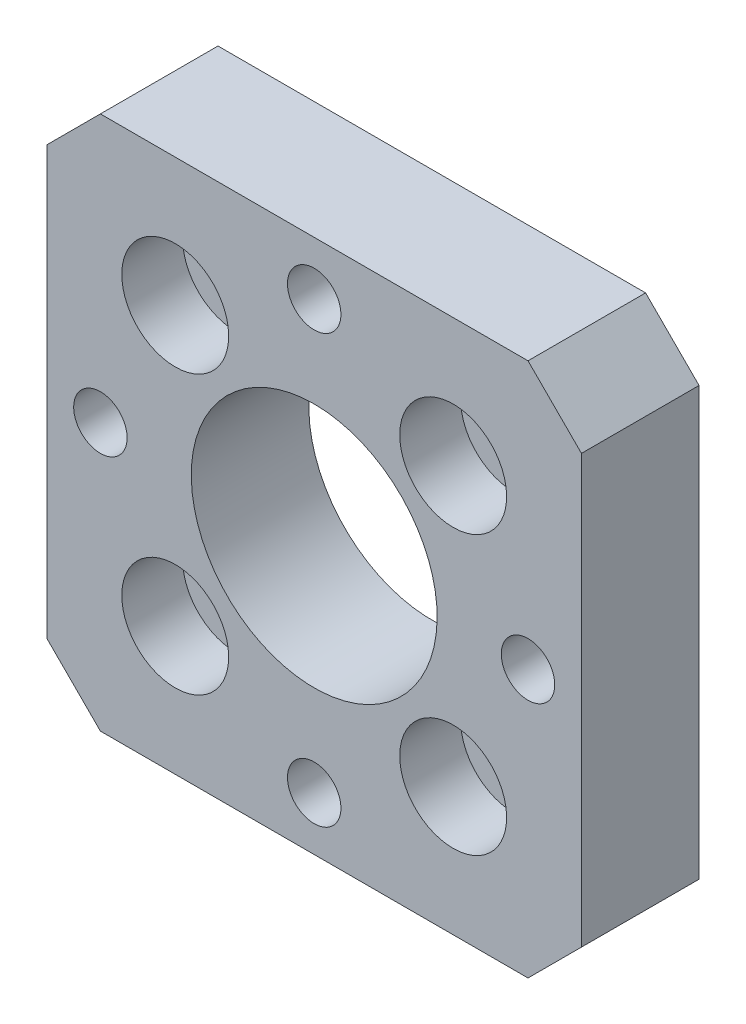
ISO-10303-21;
HEADER;
FILE_DESCRIPTION(('STEP AP214'),'2;1');
FILE_NAME('part.step','',(''),(''),'','','');
FILE_SCHEMA(('AUTOMOTIVE_DESIGN { 1 0 10303 214 1 1 1 1 }'));
ENDSEC;
DATA;
#1=APPLICATION_CONTEXT('core data for automotive mechanical design processes');
#2=APPLICATION_PROTOCOL_DEFINITION('international standard','automotive_design',2000,#1);
#3=PRODUCT_CONTEXT('',#1,'mechanical');
#4=PRODUCT('Part','Part','',(#3));
#5=PRODUCT_RELATED_PRODUCT_CATEGORY('part','',(#4));
#6=PRODUCT_DEFINITION_FORMATION('','',#4);
#7=PRODUCT_DEFINITION_CONTEXT('part definition',#1,'design');
#8=PRODUCT_DEFINITION('design','',#6,#7);
#9=PRODUCT_DEFINITION_SHAPE('','',#8);
#10=(LENGTH_UNIT() NAMED_UNIT(*) SI_UNIT(.MILLI.,.METRE.));
#11=(NAMED_UNIT(*) PLANE_ANGLE_UNIT() SI_UNIT($,.RADIAN.));
#12=(NAMED_UNIT(*) SI_UNIT($,.STERADIAN.) SOLID_ANGLE_UNIT());
#13=UNCERTAINTY_MEASURE_WITH_UNIT(LENGTH_MEASURE(1.E-05),#10,'distance_accuracy_value','');
#14=(GEOMETRIC_REPRESENTATION_CONTEXT(3) GLOBAL_UNCERTAINTY_ASSIGNED_CONTEXT((#13)) GLOBAL_UNIT_ASSIGNED_CONTEXT((#10,
#11,#12)) REPRESENTATION_CONTEXT('',''));
#15=CARTESIAN_POINT('',(0.,0.,0.));
#16=DIRECTION('',(0.,0.,1.));
#17=DIRECTION('',(1.,0.,0.));
#18=AXIS2_PLACEMENT_3D('',#15,#16,#17);
#19=CARTESIAN_POINT('',(26515.7035196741,-17322.3007866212,-13740.4776610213));
#20=DIRECTION('',(0.,0.,1.));
#21=DIRECTION('',(0.,-1.,0.));
#22=AXIS2_PLACEMENT_3D('',#19,#20,#21);
#23=CYLINDRICAL_SURFACE('',#22,5.);
#24=CARTESIAN_POINT('',(26515.7035196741,-17322.3007866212,-13746.1776610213));
#25=DIRECTION('',(0.,0.,1.));
#26=DIRECTION('',(0.,-1.,0.));
#27=AXIS2_PLACEMENT_3D('',#24,#25,#26);
#28=CIRCLE('',#27,5.);
#29=CARTESIAN_POINT('',(26515.7035196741,-17327.3007866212,-13746.1776610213));
#30=VERTEX_POINT('',#29);
#31=EDGE_CURVE('E19',#30,#30,#28,.F.);
#32=ORIENTED_EDGE('',*,*,#31,.T.);
#33=EDGE_LOOP('',(#32));
#34=FACE_BOUND('',#33,.T.);
#35=CARTESIAN_POINT('',(26515.7035196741,-17322.3007866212,-13740.4776610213));
#36=DIRECTION('',(0.,0.,1.));
#37=DIRECTION('',(0.,-1.,0.));
#38=AXIS2_PLACEMENT_3D('',#35,#36,#37);
#39=CIRCLE('',#38,5.);
#40=CARTESIAN_POINT('',(26515.7035196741,-17327.3007866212,-13740.4776610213));
#41=VERTEX_POINT('',#40);
#42=EDGE_CURVE('E165',#41,#41,#39,.F.);
#43=ORIENTED_EDGE('',*,*,#42,.F.);
#44=EDGE_LOOP('',(#43));
#45=FACE_BOUND('',#44,.T.);
#46=ADVANCED_FACE('F16',(#34,#45),#23,.F.);
#47=CARTESIAN_POINT('',(26489.7035196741,-17322.3007866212,-13740.4776610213));
#48=DIRECTION('',(0.,0.,1.));
#49=DIRECTION('',(0.,-1.,0.));
#50=AXIS2_PLACEMENT_3D('',#47,#48,#49);
#51=CYLINDRICAL_SURFACE('',#50,5.);
#52=CARTESIAN_POINT('',(26489.7035196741,-17322.3007866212,-13746.1776610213));
#53=DIRECTION('',(0.,0.,1.));
#54=DIRECTION('',(0.,-1.,0.));
#55=AXIS2_PLACEMENT_3D('',#52,#53,#54);
#56=CIRCLE('',#55,5.);
#57=CARTESIAN_POINT('',(26489.7035196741,-17327.3007866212,-13746.1776610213));
#58=VERTEX_POINT('',#57);
#59=EDGE_CURVE('E173',#58,#58,#56,.F.);
#60=ORIENTED_EDGE('',*,*,#59,.T.);
#61=EDGE_LOOP('',(#60));
#62=FACE_BOUND('',#61,.T.);
#63=CARTESIAN_POINT('',(26489.7035196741,-17322.3007866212,-13740.4776610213));
#64=DIRECTION('',(0.,0.,1.));
#65=DIRECTION('',(0.,-1.,0.));
#66=AXIS2_PLACEMENT_3D('',#63,#64,#65);
#67=CIRCLE('',#66,5.);
#68=CARTESIAN_POINT('',(26489.7035196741,-17327.3007866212,-13740.4776610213));
#69=VERTEX_POINT('',#68);
#70=EDGE_CURVE('E162',#69,#69,#67,.F.);
#71=ORIENTED_EDGE('',*,*,#70,.F.);
#72=EDGE_LOOP('',(#71));
#73=FACE_BOUND('',#72,.T.);
#74=ADVANCED_FACE('F247',(#62,#73),#51,.F.);
#75=CARTESIAN_POINT('',(26489.7035196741,-17348.3007866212,-13740.4776610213));
#76=DIRECTION('',(0.,0.,1.));
#77=DIRECTION('',(0.,-1.,0.));
#78=AXIS2_PLACEMENT_3D('',#75,#76,#77);
#79=CYLINDRICAL_SURFACE('',#78,5.);
#80=CARTESIAN_POINT('',(26489.7035196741,-17348.3007866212,-13746.1776610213));
#81=DIRECTION('',(0.,0.,1.));
#82=DIRECTION('',(0.,-1.,0.));
#83=AXIS2_PLACEMENT_3D('',#80,#81,#82);
#84=CIRCLE('',#83,5.);
#85=CARTESIAN_POINT('',(26489.7035196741,-17353.3007866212,-13746.1776610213));
#86=VERTEX_POINT('',#85);
#87=EDGE_CURVE('E171',#86,#86,#84,.F.);
#88=ORIENTED_EDGE('',*,*,#87,.T.);
#89=EDGE_LOOP('',(#88));
#90=FACE_BOUND('',#89,.T.);
#91=CARTESIAN_POINT('',(26489.7035196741,-17348.3007866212,-13740.4776610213));
#92=DIRECTION('',(0.,0.,1.));
#93=DIRECTION('',(0.,-1.,0.));
#94=AXIS2_PLACEMENT_3D('',#91,#92,#93);
#95=CIRCLE('',#94,5.);
#96=CARTESIAN_POINT('',(26489.7035196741,-17353.3007866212,-13740.4776610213));
#97=VERTEX_POINT('',#96);
#98=EDGE_CURVE('E159',#97,#97,#95,.F.);
#99=ORIENTED_EDGE('',*,*,#98,.F.);
#100=EDGE_LOOP('',(#99));
#101=FACE_BOUND('',#100,.T.);
#102=ADVANCED_FACE('F244',(#90,#101),#79,.F.);
#103=CARTESIAN_POINT('',(26515.7035196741,-17348.3007866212,-13740.4776610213));
#104=DIRECTION('',(0.,0.,1.));
#105=DIRECTION('',(0.,-1.,0.));
#106=AXIS2_PLACEMENT_3D('',#103,#104,#105);
#107=CYLINDRICAL_SURFACE('',#106,5.);
#108=CARTESIAN_POINT('',(26515.7035196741,-17348.3007866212,-13746.1776610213));
#109=DIRECTION('',(0.,0.,1.));
#110=DIRECTION('',(0.,-1.,0.));
#111=AXIS2_PLACEMENT_3D('',#108,#109,#110);
#112=CIRCLE('',#111,5.);
#113=CARTESIAN_POINT('',(26515.7035196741,-17353.3007866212,-13746.1776610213));
#114=VERTEX_POINT('',#113);
#115=EDGE_CURVE('E168',#114,#114,#112,.F.);
#116=ORIENTED_EDGE('',*,*,#115,.T.);
#117=EDGE_LOOP('',(#116));
#118=FACE_BOUND('',#117,.T.);
#119=CARTESIAN_POINT('',(26515.7035196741,-17348.3007866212,-13740.4776610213));
#120=DIRECTION('',(0.,0.,1.));
#121=DIRECTION('',(0.,-1.,0.));
#122=AXIS2_PLACEMENT_3D('',#119,#120,#121);
#123=CIRCLE('',#122,5.);
#124=CARTESIAN_POINT('',(26515.7035196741,-17353.3007866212,-13740.4776610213));
#125=VERTEX_POINT('',#124);
#126=EDGE_CURVE('E156',#125,#125,#123,.F.);
#127=ORIENTED_EDGE('',*,*,#126,.F.);
#128=EDGE_LOOP('',(#127));
#129=FACE_BOUND('',#128,.T.);
#130=ADVANCED_FACE('F186',(#118,#129),#107,.F.);
#131=CARTESIAN_POINT('',(26515.7035196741,-17325.0507866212,-13746.1776610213));
#132=DIRECTION('',(0.,0.,-1.));
#133=DIRECTION('',(0.,1.,0.));
#134=AXIS2_PLACEMENT_3D('',#131,#132,#133);
#135=PLANE('',#134);
#136=ORIENTED_EDGE('',*,*,#31,.F.);
#137=EDGE_LOOP('',(#136));
#138=FACE_BOUND('',#137,.T.);
#139=CARTESIAN_POINT('',(26515.7035196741,-17322.3007866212,-13746.1776610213));
#140=DIRECTION('',(0.,0.,1.));
#141=DIRECTION('',(0.,-1.,0.));
#142=AXIS2_PLACEMENT_3D('',#139,#140,#141);
#143=CIRCLE('',#142,2.75);
#144=CARTESIAN_POINT('',(26515.7035196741,-17325.0507866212,-13746.1776610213));
#145=VERTEX_POINT('',#144);
#146=EDGE_CURVE('E141',#145,#145,#143,.F.);
#147=ORIENTED_EDGE('',*,*,#146,.T.);
#148=EDGE_LOOP('',(#147));
#149=FACE_BOUND('',#148,.T.);
#150=ADVANCED_FACE('F182',(#138,#149),#135,.F.);
#151=CARTESIAN_POINT('',(26489.7035196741,-17325.0507866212,-13746.1776610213));
#152=DIRECTION('',(0.,0.,-1.));
#153=DIRECTION('',(0.,1.,0.));
#154=AXIS2_PLACEMENT_3D('',#151,#152,#153);
#155=PLANE('',#154);
#156=ORIENTED_EDGE('',*,*,#59,.F.);
#157=EDGE_LOOP('',(#156));
#158=FACE_BOUND('',#157,.T.);
#159=CARTESIAN_POINT('',(26489.7035196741,-17322.3007866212,-13746.1776610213));
#160=DIRECTION('',(0.,0.,1.));
#161=DIRECTION('',(0.,-1.,0.));
#162=AXIS2_PLACEMENT_3D('',#159,#160,#161);
#163=CIRCLE('',#162,2.75);
#164=CARTESIAN_POINT('',(26489.7035196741,-17325.0507866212,-13746.1776610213));
#165=VERTEX_POINT('',#164);
#166=EDGE_CURVE('E138',#165,#165,#163,.F.);
#167=ORIENTED_EDGE('',*,*,#166,.T.);
#168=EDGE_LOOP('',(#167));
#169=FACE_BOUND('',#168,.T.);
#170=ADVANCED_FACE('F185',(#158,#169),#155,.F.);
#171=CARTESIAN_POINT('',(26489.7035196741,-17351.0507866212,-13746.1776610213));
#172=DIRECTION('',(0.,0.,-1.));
#173=DIRECTION('',(0.,1.,0.));
#174=AXIS2_PLACEMENT_3D('',#171,#172,#173);
#175=PLANE('',#174);
#176=ORIENTED_EDGE('',*,*,#87,.F.);
#177=EDGE_LOOP('',(#176));
#178=FACE_BOUND('',#177,.T.);
#179=CARTESIAN_POINT('',(26489.7035196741,-17348.3007866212,-13746.1776610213));
#180=DIRECTION('',(0.,0.,1.));
#181=DIRECTION('',(0.,-1.,0.));
#182=AXIS2_PLACEMENT_3D('',#179,#180,#181);
#183=CIRCLE('',#182,2.75);
#184=CARTESIAN_POINT('',(26489.7035196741,-17351.0507866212,-13746.1776610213));
#185=VERTEX_POINT('',#184);
#186=EDGE_CURVE('E135',#185,#185,#183,.F.);
#187=ORIENTED_EDGE('',*,*,#186,.T.);
#188=EDGE_LOOP('',(#187));
#189=FACE_BOUND('',#188,.T.);
#190=ADVANCED_FACE('F234',(#178,#189),#175,.F.);
#191=CARTESIAN_POINT('',(26515.7035196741,-17351.0507866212,-13746.1776610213));
#192=DIRECTION('',(0.,0.,-1.));
#193=DIRECTION('',(0.,1.,0.));
#194=AXIS2_PLACEMENT_3D('',#191,#192,#193);
#195=PLANE('',#194);
#196=ORIENTED_EDGE('',*,*,#115,.F.);
#197=EDGE_LOOP('',(#196));
#198=FACE_BOUND('',#197,.T.);
#199=CARTESIAN_POINT('',(26515.7035196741,-17348.3007866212,-13746.1776610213));
#200=DIRECTION('',(0.,0.,1.));
#201=DIRECTION('',(0.,-1.,0.));
#202=AXIS2_PLACEMENT_3D('',#199,#200,#201);
#203=CIRCLE('',#202,2.75);
#204=CARTESIAN_POINT('',(26515.7035196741,-17351.0507866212,-13746.1776610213));
#205=VERTEX_POINT('',#204);
#206=EDGE_CURVE('E91',#205,#205,#203,.F.);
#207=ORIENTED_EDGE('',*,*,#206,.T.);
#208=EDGE_LOOP('',(#207));
#209=FACE_BOUND('',#208,.T.);
#210=ADVANCED_FACE('F226',(#198,#209),#195,.F.);
#211=CARTESIAN_POINT('',(26477.7035196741,-17310.3007866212,-13740.4776610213));
#212=DIRECTION('',(0.,0.,1.));
#213=DIRECTION('',(0.,-1.,0.));
#214=AXIS2_PLACEMENT_3D('',#211,#212,#213);
#215=PLANE('',#214);
#216=CARTESIAN_POINT('',(26502.7035196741,-17335.3007866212,-13740.4776610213));
#217=DIRECTION('',(0.,0.,-1.));
#218=DIRECTION('',(0.,1.,0.));
#219=AXIS2_PLACEMENT_3D('',#216,#217,#218);
#220=CIRCLE('',#219,11.5);
#221=CARTESIAN_POINT('',(26502.7035196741,-17323.8007866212,-13740.4776610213));
#222=VERTEX_POINT('',#221);
#223=EDGE_CURVE('E130',#222,#222,#220,.T.);
#224=ORIENTED_EDGE('',*,*,#223,.T.);
#225=EDGE_LOOP('',(#224));
#226=FACE_BOUND('',#225,.T.);
#227=DIRECTION('',(1.,0.,0.));
#228=VECTOR('',#227,1.);
#229=CARTESIAN_POINT('',(26527.7035196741,-17360.3007866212,-13740.4776610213));
#230=LINE('',#229,#228);
#231=CARTESIAN_POINT('',(26482.7035196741,-17360.3007866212,-13740.4776610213));
#232=VERTEX_POINT('',#231);
#233=CARTESIAN_POINT('',(26522.7035196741,-17360.3007866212,-13740.4776610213));
#234=VERTEX_POINT('',#233);
#235=EDGE_CURVE('E376',#232,#234,#230,.T.);
#236=ORIENTED_EDGE('',*,*,#235,.T.);
#237=DIRECTION('',(-0.707106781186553,-0.707106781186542,0.));
#238=VECTOR('',#237,1.);
#239=CARTESIAN_POINT('',(26527.7035196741,-17355.3007866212,-13740.4776610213));
#240=LINE('',#239,#238);
#241=CARTESIAN_POINT('',(26527.7035196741,-17355.3007866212,-13740.4776610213));
#242=VERTEX_POINT('',#241);
#243=EDGE_CURVE('E371',#234,#242,#240,.F.);
#244=ORIENTED_EDGE('',*,*,#243,.T.);
#245=DIRECTION('',(0.,-1.,0.));
#246=VECTOR('',#245,1.);
#247=CARTESIAN_POINT('',(26527.7035196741,-17310.3007866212,-13740.4776610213));
#248=LINE('',#247,#246);
#249=CARTESIAN_POINT('',(26527.7035196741,-17315.3007866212,-13740.4776610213));
#250=VERTEX_POINT('',#249);
#251=EDGE_CURVE('E368',#242,#250,#248,.F.);
#252=ORIENTED_EDGE('',*,*,#251,.T.);
#253=DIRECTION('',(0.707106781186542,-0.707106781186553,0.));
#254=VECTOR('',#253,1.);
#255=CARTESIAN_POINT('',(26522.7035196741,-17310.3007866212,-13740.4776610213));
#256=LINE('',#255,#254);
#257=CARTESIAN_POINT('',(26522.7035196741,-17310.3007866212,-13740.4776610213));
#258=VERTEX_POINT('',#257);
#259=EDGE_CURVE('E365',#250,#258,#256,.F.);
#260=ORIENTED_EDGE('',*,*,#259,.T.);
#261=DIRECTION('',(1.,0.,0.));
#262=VECTOR('',#261,1.);
#263=CARTESIAN_POINT('',(26527.7035196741,-17310.3007866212,-13740.4776610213));
#264=LINE('',#263,#262);
#265=CARTESIAN_POINT('',(26482.7035196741,-17310.3007866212,-13740.4776610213));
#266=VERTEX_POINT('',#265);
#267=EDGE_CURVE('E85',#258,#266,#264,.F.);
#268=ORIENTED_EDGE('',*,*,#267,.T.);
#269=DIRECTION('',(0.707106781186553,0.707106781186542,0.));
#270=VECTOR('',#269,1.);
#271=CARTESIAN_POINT('',(26477.7035196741,-17315.3007866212,-13740.4776610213));
#272=LINE('',#271,#270);
#273=CARTESIAN_POINT('',(26477.7035196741,-17315.3007866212,-13740.4776610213));
#274=VERTEX_POINT('',#273);
#275=EDGE_CURVE('E82',#266,#274,#272,.F.);
#276=ORIENTED_EDGE('',*,*,#275,.T.);
#277=DIRECTION('',(0.,1.,0.));
#278=VECTOR('',#277,1.);
#279=CARTESIAN_POINT('',(26477.7035196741,-17310.3007866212,-13740.4776610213));
#280=LINE('',#279,#278);
#281=CARTESIAN_POINT('',(26477.7035196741,-17355.3007866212,-13740.4776610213));
#282=VERTEX_POINT('',#281);
#283=EDGE_CURVE('E79',#274,#282,#280,.F.);
#284=ORIENTED_EDGE('',*,*,#283,.T.);
#285=DIRECTION('',(-0.707106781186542,0.707106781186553,0.));
#286=VECTOR('',#285,1.);
#287=CARTESIAN_POINT('',(26482.7035196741,-17360.3007866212,-13740.4776610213));
#288=LINE('',#287,#286);
#289=EDGE_CURVE('E381',#282,#232,#288,.F.);
#290=ORIENTED_EDGE('',*,*,#289,.T.);
#291=EDGE_LOOP('',(#236,#244,#252,#260,#268,#276,#284,#290));
#292=FACE_BOUND('',#291,.T.);
#293=ORIENTED_EDGE('',*,*,#126,.T.);
#294=EDGE_LOOP('',(#293));
#295=FACE_BOUND('',#294,.T.);
#296=ORIENTED_EDGE('',*,*,#98,.T.);
#297=EDGE_LOOP('',(#296));
#298=FACE_BOUND('',#297,.T.);
#299=ORIENTED_EDGE('',*,*,#70,.T.);
#300=EDGE_LOOP('',(#299));
#301=FACE_BOUND('',#300,.T.);
#302=ORIENTED_EDGE('',*,*,#42,.T.);
#303=EDGE_LOOP('',(#302));
#304=FACE_BOUND('',#303,.T.);
#305=CARTESIAN_POINT('',(26502.7035196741,-17355.3007866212,-13740.4776610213));
#306=DIRECTION('',(0.,0.,1.));
#307=DIRECTION('',(0.,-1.,0.));
#308=AXIS2_PLACEMENT_3D('',#305,#306,#307);
#309=CIRCLE('',#308,2.5);
#310=CARTESIAN_POINT('',(26502.7035196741,-17357.8007866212,-13740.4776610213));
#311=VERTEX_POINT('',#310);
#312=EDGE_CURVE('E144',#311,#311,#309,.F.);
#313=ORIENTED_EDGE('',*,*,#312,.T.);
#314=EDGE_LOOP('',(#313));
#315=FACE_BOUND('',#314,.T.);
#316=CARTESIAN_POINT('',(26502.7035196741,-17315.3007866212,-13740.4776610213));
#317=DIRECTION('',(0.,0.,1.));
#318=DIRECTION('',(0.,-1.,0.));
#319=AXIS2_PLACEMENT_3D('',#316,#317,#318);
#320=CIRCLE('',#319,2.5);
#321=CARTESIAN_POINT('',(26502.7035196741,-17317.8007866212,-13740.4776610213));
#322=VERTEX_POINT('',#321);
#323=EDGE_CURVE('E147',#322,#322,#320,.F.);
#324=ORIENTED_EDGE('',*,*,#323,.T.);
#325=EDGE_LOOP('',(#324));
#326=FACE_BOUND('',#325,.T.);
#327=CARTESIAN_POINT('',(26482.7035196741,-17335.3007866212,-13740.4776610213));
#328=DIRECTION('',(0.,0.,1.));
#329=DIRECTION('',(0.,-1.,0.));
#330=AXIS2_PLACEMENT_3D('',#327,#328,#329);
#331=CIRCLE('',#330,2.5);
#332=CARTESIAN_POINT('',(26482.7035196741,-17337.8007866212,-13740.4776610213));
#333=VERTEX_POINT('',#332);
#334=EDGE_CURVE('E150',#333,#333,#331,.F.);
#335=ORIENTED_EDGE('',*,*,#334,.T.);
#336=EDGE_LOOP('',(#335));
#337=FACE_BOUND('',#336,.T.);
#338=CARTESIAN_POINT('',(26522.7035196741,-17335.3007866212,-13740.4776610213));
#339=DIRECTION('',(0.,0.,1.));
#340=DIRECTION('',(0.,-1.,0.));
#341=AXIS2_PLACEMENT_3D('',#338,#339,#340);
#342=CIRCLE('',#341,2.5);
#343=CARTESIAN_POINT('',(26522.7035196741,-17337.8007866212,-13740.4776610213));
#344=VERTEX_POINT('',#343);
#345=EDGE_CURVE('E153',#344,#344,#342,.F.);
#346=ORIENTED_EDGE('',*,*,#345,.T.);
#347=EDGE_LOOP('',(#346));
#348=FACE_BOUND('',#347,.T.);
#349=ADVANCED_FACE('F83',(#226,#292,#295,#298,#301,#304,#315,#326,#337,#348),#215,.T.);
#350=CARTESIAN_POINT('',(26522.7035196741,-17335.3007866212,-13740.4776610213));
#351=DIRECTION('',(0.,0.,1.));
#352=DIRECTION('',(0.,-1.,0.));
#353=AXIS2_PLACEMENT_3D('',#350,#351,#352);
#354=CYLINDRICAL_SURFACE('',#353,2.5);
#355=ORIENTED_EDGE('',*,*,#345,.F.);
#356=EDGE_LOOP('',(#355));
#357=FACE_BOUND('',#356,.T.);
#358=CARTESIAN_POINT('',(26522.7035196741,-17335.3007866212,-13751.4776610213));
#359=DIRECTION('',(0.,0.,1.));
#360=DIRECTION('',(0.,-1.,0.));
#361=AXIS2_PLACEMENT_3D('',#358,#359,#360);
#362=CIRCLE('',#361,2.5);
#363=CARTESIAN_POINT('',(26522.7035196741,-17337.8007866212,-13751.4776610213));
#364=VERTEX_POINT('',#363);
#365=EDGE_CURVE('E127',#364,#364,#362,.F.);
#366=ORIENTED_EDGE('',*,*,#365,.T.);
#367=EDGE_LOOP('',(#366));
#368=FACE_BOUND('',#367,.T.);
#369=ADVANCED_FACE('F212',(#357,#368),#354,.F.);
#370=CARTESIAN_POINT('',(26482.7035196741,-17335.3007866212,-13740.4776610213));
#371=DIRECTION('',(0.,0.,1.));
#372=DIRECTION('',(0.,-1.,0.));
#373=AXIS2_PLACEMENT_3D('',#370,#371,#372);
#374=CYLINDRICAL_SURFACE('',#373,2.5);
#375=ORIENTED_EDGE('',*,*,#334,.F.);
#376=EDGE_LOOP('',(#375));
#377=FACE_BOUND('',#376,.T.);
#378=CARTESIAN_POINT('',(26482.7035196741,-17335.3007866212,-13751.4776610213));
#379=DIRECTION('',(0.,0.,1.));
#380=DIRECTION('',(0.,-1.,0.));
#381=AXIS2_PLACEMENT_3D('',#378,#379,#380);
#382=CIRCLE('',#381,2.5);
#383=CARTESIAN_POINT('',(26482.7035196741,-17337.8007866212,-13751.4776610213));
#384=VERTEX_POINT('',#383);
#385=EDGE_CURVE('E124',#384,#384,#382,.F.);
#386=ORIENTED_EDGE('',*,*,#385,.T.);
#387=EDGE_LOOP('',(#386));
#388=FACE_BOUND('',#387,.T.);
#389=ADVANCED_FACE('F214',(#377,#388),#374,.F.);
#390=CARTESIAN_POINT('',(26502.7035196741,-17315.3007866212,-13740.4776610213));
#391=DIRECTION('',(0.,0.,1.));
#392=DIRECTION('',(0.,-1.,0.));
#393=AXIS2_PLACEMENT_3D('',#390,#391,#392);
#394=CYLINDRICAL_SURFACE('',#393,2.5);
#395=ORIENTED_EDGE('',*,*,#323,.F.);
#396=EDGE_LOOP('',(#395));
#397=FACE_BOUND('',#396,.T.);
#398=CARTESIAN_POINT('',(26502.7035196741,-17315.3007866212,-13751.4776610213));
#399=DIRECTION('',(0.,0.,1.));
#400=DIRECTION('',(0.,-1.,0.));
#401=AXIS2_PLACEMENT_3D('',#398,#399,#400);
#402=CIRCLE('',#401,2.5);
#403=CARTESIAN_POINT('',(26502.7035196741,-17317.8007866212,-13751.4776610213));
#404=VERTEX_POINT('',#403);
#405=EDGE_CURVE('E121',#404,#404,#402,.F.);
#406=ORIENTED_EDGE('',*,*,#405,.T.);
#407=EDGE_LOOP('',(#406));
#408=FACE_BOUND('',#407,.T.);
#409=ADVANCED_FACE('F223',(#397,#408),#394,.F.);
#410=CARTESIAN_POINT('',(26502.7035196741,-17355.3007866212,-13740.4776610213));
#411=DIRECTION('',(0.,0.,1.));
#412=DIRECTION('',(0.,-1.,0.));
#413=AXIS2_PLACEMENT_3D('',#410,#411,#412);
#414=CYLINDRICAL_SURFACE('',#413,2.5);
#415=ORIENTED_EDGE('',*,*,#312,.F.);
#416=EDGE_LOOP('',(#415));
#417=FACE_BOUND('',#416,.T.);
#418=CARTESIAN_POINT('',(26502.7035196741,-17355.3007866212,-13751.4776610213));
#419=DIRECTION('',(0.,0.,1.));
#420=DIRECTION('',(0.,-1.,0.));
#421=AXIS2_PLACEMENT_3D('',#418,#419,#420);
#422=CIRCLE('',#421,2.5);
#423=CARTESIAN_POINT('',(26502.7035196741,-17357.8007866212,-13751.4776610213));
#424=VERTEX_POINT('',#423);
#425=EDGE_CURVE('E118',#424,#424,#422,.F.);
#426=ORIENTED_EDGE('',*,*,#425,.T.);
#427=EDGE_LOOP('',(#426));
#428=FACE_BOUND('',#427,.T.);
#429=ADVANCED_FACE('F194',(#417,#428),#414,.F.);
#430=CARTESIAN_POINT('',(26515.7035196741,-17322.3007866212,-13740.4776610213));
#431=DIRECTION('',(0.,0.,1.));
#432=DIRECTION('',(0.,-1.,0.));
#433=AXIS2_PLACEMENT_3D('',#430,#431,#432);
#434=CYLINDRICAL_SURFACE('',#433,2.75);
#435=ORIENTED_EDGE('',*,*,#146,.F.);
#436=EDGE_LOOP('',(#435));
#437=FACE_BOUND('',#436,.T.);
#438=CARTESIAN_POINT('',(26515.7035196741,-17322.3007866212,-13751.4776610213));
#439=DIRECTION('',(0.,0.,1.));
#440=DIRECTION('',(0.,-1.,0.));
#441=AXIS2_PLACEMENT_3D('',#438,#439,#440);
#442=CIRCLE('',#441,2.75);
#443=CARTESIAN_POINT('',(26515.7035196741,-17325.0507866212,-13751.4776610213));
#444=VERTEX_POINT('',#443);
#445=EDGE_CURVE('E115',#444,#444,#442,.F.);
#446=ORIENTED_EDGE('',*,*,#445,.T.);
#447=EDGE_LOOP('',(#446));
#448=FACE_BOUND('',#447,.T.);
#449=ADVANCED_FACE('F190',(#437,#448),#434,.F.);
#450=CARTESIAN_POINT('',(26489.7035196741,-17322.3007866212,-13740.4776610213));
#451=DIRECTION('',(0.,0.,1.));
#452=DIRECTION('',(0.,-1.,0.));
#453=AXIS2_PLACEMENT_3D('',#450,#451,#452);
#454=CYLINDRICAL_SURFACE('',#453,2.75);
#455=ORIENTED_EDGE('',*,*,#166,.F.);
#456=EDGE_LOOP('',(#455));
#457=FACE_BOUND('',#456,.T.);
#458=CARTESIAN_POINT('',(26489.7035196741,-17322.3007866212,-13751.4776610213));
#459=DIRECTION('',(0.,0.,1.));
#460=DIRECTION('',(0.,-1.,0.));
#461=AXIS2_PLACEMENT_3D('',#458,#459,#460);
#462=CIRCLE('',#461,2.75);
#463=CARTESIAN_POINT('',(26489.7035196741,-17325.0507866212,-13751.4776610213));
#464=VERTEX_POINT('',#463);
#465=EDGE_CURVE('E112',#464,#464,#462,.F.);
#466=ORIENTED_EDGE('',*,*,#465,.T.);
#467=EDGE_LOOP('',(#466));
#468=FACE_BOUND('',#467,.T.);
#469=ADVANCED_FACE('F193',(#457,#468),#454,.F.);
#470=CARTESIAN_POINT('',(26489.7035196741,-17348.3007866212,-13740.4776610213));
#471=DIRECTION('',(0.,0.,1.));
#472=DIRECTION('',(0.,-1.,0.));
#473=AXIS2_PLACEMENT_3D('',#470,#471,#472);
#474=CYLINDRICAL_SURFACE('',#473,2.75);
#475=ORIENTED_EDGE('',*,*,#186,.F.);
#476=EDGE_LOOP('',(#475));
#477=FACE_BOUND('',#476,.T.);
#478=CARTESIAN_POINT('',(26489.7035196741,-17348.3007866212,-13751.4776610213));
#479=DIRECTION('',(0.,0.,1.));
#480=DIRECTION('',(0.,-1.,0.));
#481=AXIS2_PLACEMENT_3D('',#478,#479,#480);
#482=CIRCLE('',#481,2.75);
#483=CARTESIAN_POINT('',(26489.7035196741,-17351.0507866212,-13751.4776610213));
#484=VERTEX_POINT('',#483);
#485=EDGE_CURVE('E109',#484,#484,#482,.F.);
#486=ORIENTED_EDGE('',*,*,#485,.T.);
#487=EDGE_LOOP('',(#486));
#488=FACE_BOUND('',#487,.T.);
#489=ADVANCED_FACE('F279',(#477,#488),#474,.F.);
#490=CARTESIAN_POINT('',(26515.7035196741,-17348.3007866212,-13740.4776610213));
#491=DIRECTION('',(0.,0.,1.));
#492=DIRECTION('',(0.,-1.,0.));
#493=AXIS2_PLACEMENT_3D('',#490,#491,#492);
#494=CYLINDRICAL_SURFACE('',#493,2.75);
#495=ORIENTED_EDGE('',*,*,#206,.F.);
#496=EDGE_LOOP('',(#495));
#497=FACE_BOUND('',#496,.T.);
#498=CARTESIAN_POINT('',(26515.7035196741,-17348.3007866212,-13751.4776610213));
#499=DIRECTION('',(0.,0.,1.));
#500=DIRECTION('',(0.,-1.,0.));
#501=AXIS2_PLACEMENT_3D('',#498,#499,#500);
#502=CIRCLE('',#501,2.75);
#503=CARTESIAN_POINT('',(26515.7035196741,-17351.0507866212,-13751.4776610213));
#504=VERTEX_POINT('',#503);
#505=EDGE_CURVE('E106',#504,#504,#502,.F.);
#506=ORIENTED_EDGE('',*,*,#505,.T.);
#507=EDGE_LOOP('',(#506));
#508=FACE_BOUND('',#507,.T.);
#509=ADVANCED_FACE('F283',(#497,#508),#494,.F.);
#510=CARTESIAN_POINT('',(26477.7035196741,-17315.3007866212,-13740.4776610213));
#511=DIRECTION('',(0.707106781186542,-0.707106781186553,0.));
#512=DIRECTION('',(0.707106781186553,0.707106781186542,0.));
#513=AXIS2_PLACEMENT_3D('',#510,#511,#512);
#514=PLANE('',#513);
#515=DIRECTION('',(0.,0.,-1.));
#516=VECTOR('',#515,1.);
#517=CARTESIAN_POINT('',(26482.7035196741,-17310.3007866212,-13740.4776610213));
#518=LINE('',#517,#516);
#519=CARTESIAN_POINT('',(26482.7035196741,-17310.3007866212,-13751.4776610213));
#520=VERTEX_POINT('',#519);
#521=EDGE_CURVE('E363',#266,#520,#518,.T.);
#522=ORIENTED_EDGE('',*,*,#521,.T.);
#523=DIRECTION('',(-0.707106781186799,-0.707106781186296,0.));
#524=VECTOR('',#523,1.);
#525=CARTESIAN_POINT('',(26482.7035196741,-17310.3007866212,-13751.4776610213));
#526=LINE('',#525,#524);
#527=CARTESIAN_POINT('',(26477.7035196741,-17315.3007866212,-13751.4776610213));
#528=VERTEX_POINT('',#527);
#529=EDGE_CURVE('E102',#520,#528,#526,.T.);
#530=ORIENTED_EDGE('',*,*,#529,.T.);
#531=DIRECTION('',(0.,0.,1.));
#532=VECTOR('',#531,1.);
#533=CARTESIAN_POINT('',(26477.7035196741,-17315.3007866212,-13740.4776610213));
#534=LINE('',#533,#532);
#535=EDGE_CURVE('E90',#528,#274,#534,.T.);
#536=ORIENTED_EDGE('',*,*,#535,.T.);
#537=ORIENTED_EDGE('',*,*,#275,.F.);
#538=EDGE_LOOP('',(#522,#530,#536,#537));
#539=FACE_BOUND('',#538,.T.);
#540=ADVANCED_FACE('F101',(#539),#514,.F.);
#541=CARTESIAN_POINT('',(26477.7035196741,-17310.3007866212,-13740.4776610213));
#542=DIRECTION('',(1.,0.,0.));
#543=DIRECTION('',(0.,1.,0.));
#544=AXIS2_PLACEMENT_3D('',#541,#542,#543);
#545=PLANE('',#544);
#546=ORIENTED_EDGE('',*,*,#535,.F.);
#547=DIRECTION('',(0.,-1.,0.));
#548=VECTOR('',#547,1.);
#549=CARTESIAN_POINT('',(26477.7035196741,-17310.3007866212,-13751.4776610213));
#550=LINE('',#549,#548);
#551=CARTESIAN_POINT('',(26477.7035196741,-17355.3007866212,-13751.4776610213));
#552=VERTEX_POINT('',#551);
#553=EDGE_CURVE('E358',#528,#552,#550,.T.);
#554=ORIENTED_EDGE('',*,*,#553,.T.);
#555=DIRECTION('',(0.,0.,1.));
#556=VECTOR('',#555,1.);
#557=CARTESIAN_POINT('',(26477.7035196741,-17355.3007866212,-13740.4776610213));
#558=LINE('',#557,#556);
#559=EDGE_CURVE('E98',#552,#282,#558,.T.);
#560=ORIENTED_EDGE('',*,*,#559,.T.);
#561=ORIENTED_EDGE('',*,*,#283,.F.);
#562=EDGE_LOOP('',(#546,#554,#560,#561));
#563=FACE_BOUND('',#562,.T.);
#564=ADVANCED_FACE('F95',(#563),#545,.F.);
#565=CARTESIAN_POINT('',(26482.7035196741,-17360.3007866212,-13740.4776610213));
#566=DIRECTION('',(0.707106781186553,0.707106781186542,0.));
#567=DIRECTION('',(-0.707106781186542,0.707106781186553,0.));
#568=AXIS2_PLACEMENT_3D('',#565,#566,#567);
#569=PLANE('',#568);
#570=ORIENTED_EDGE('',*,*,#559,.F.);
#571=DIRECTION('',(0.707106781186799,-0.707106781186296,0.));
#572=VECTOR('',#571,1.);
#573=CARTESIAN_POINT('',(26477.7035196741,-17355.3007866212,-13751.4776610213));
#574=LINE('',#573,#572);
#575=CARTESIAN_POINT('',(26482.7035196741,-17360.3007866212,-13751.4776610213));
#576=VERTEX_POINT('',#575);
#577=EDGE_CURVE('E355',#552,#576,#574,.T.);
#578=ORIENTED_EDGE('',*,*,#577,.T.);
#579=DIRECTION('',(0.,0.,1.));
#580=VECTOR('',#579,1.);
#581=CARTESIAN_POINT('',(26482.7035196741,-17360.3007866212,-13740.4776610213));
#582=LINE('',#581,#580);
#583=EDGE_CURVE('E378',#576,#232,#582,.T.);
#584=ORIENTED_EDGE('',*,*,#583,.T.);
#585=ORIENTED_EDGE('',*,*,#289,.F.);
#586=EDGE_LOOP('',(#570,#578,#584,#585));
#587=FACE_BOUND('',#586,.T.);
#588=ADVANCED_FACE('F292',(#587),#569,.F.);
#589=CARTESIAN_POINT('',(26527.7035196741,-17360.3007866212,-13740.4776610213));
#590=DIRECTION('',(0.,1.,0.));
#591=DIRECTION('',(0.,0.,1.));
#592=AXIS2_PLACEMENT_3D('',#589,#590,#591);
#593=PLANE('',#592);
#594=ORIENTED_EDGE('',*,*,#583,.F.);
#595=DIRECTION('',(1.,0.,0.));
#596=VECTOR('',#595,1.);
#597=CARTESIAN_POINT('',(26477.7035196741,-17360.3007866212,-13751.4776610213));
#598=LINE('',#597,#596);
#599=CARTESIAN_POINT('',(26522.7035196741,-17360.3007866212,-13751.4776610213));
#600=VERTEX_POINT('',#599);
#601=EDGE_CURVE('E349',#576,#600,#598,.T.);
#602=ORIENTED_EDGE('',*,*,#601,.T.);
#603=DIRECTION('',(0.,0.,1.));
#604=VECTOR('',#603,1.);
#605=CARTESIAN_POINT('',(26522.7035196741,-17360.3007866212,-13740.4776610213));
#606=LINE('',#605,#604);
#607=EDGE_CURVE('E373',#600,#234,#606,.T.);
#608=ORIENTED_EDGE('',*,*,#607,.T.);
#609=ORIENTED_EDGE('',*,*,#235,.F.);
#610=EDGE_LOOP('',(#594,#602,#608,#609));
#611=FACE_BOUND('',#610,.T.);
#612=ADVANCED_FACE('F295',(#611),#593,.F.);
#613=CARTESIAN_POINT('',(26527.7035196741,-17355.3007866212,-13740.4776610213));
#614=DIRECTION('',(-0.707106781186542,0.707106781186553,0.));
#615=DIRECTION('',(-0.707106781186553,-0.707106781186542,0.));
#616=AXIS2_PLACEMENT_3D('',#613,#614,#615);
#617=PLANE('',#616);
#618=ORIENTED_EDGE('',*,*,#607,.F.);
#619=DIRECTION('',(0.707106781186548,0.707106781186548,0.));
#620=VECTOR('',#619,1.);
#621=CARTESIAN_POINT('',(26522.7035196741,-17360.3007866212,-13751.4776610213));
#622=LINE('',#621,#620);
#623=CARTESIAN_POINT('',(26527.7035196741,-17355.3007866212,-13751.4776610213));
#624=VERTEX_POINT('',#623);
#625=EDGE_CURVE('E347',#600,#624,#622,.T.);
#626=ORIENTED_EDGE('',*,*,#625,.T.);
#627=DIRECTION('',(0.,0.,1.));
#628=VECTOR('',#627,1.);
#629=CARTESIAN_POINT('',(26527.7035196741,-17355.3007866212,-13740.4776610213));
#630=LINE('',#629,#628);
#631=EDGE_CURVE('E346',#624,#242,#630,.T.);
#632=ORIENTED_EDGE('',*,*,#631,.T.);
#633=ORIENTED_EDGE('',*,*,#243,.F.);
#634=EDGE_LOOP('',(#618,#626,#632,#633));
#635=FACE_BOUND('',#634,.T.);
#636=ADVANCED_FACE('F299',(#635),#617,.F.);
#637=CARTESIAN_POINT('',(26527.7035196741,-17310.3007866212,-13740.4776610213));
#638=DIRECTION('',(-1.,0.,0.));
#639=DIRECTION('',(0.,-1.,0.));
#640=AXIS2_PLACEMENT_3D('',#637,#638,#639);
#641=PLANE('',#640);
#642=DIRECTION('',(0.,0.,1.));
#643=VECTOR('',#642,1.);
#644=CARTESIAN_POINT('',(26527.7035196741,-17315.3007866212,-13740.4776610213));
#645=LINE('',#644,#643);
#646=CARTESIAN_POINT('',(26527.7035196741,-17315.3007866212,-13751.4776610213));
#647=VERTEX_POINT('',#646);
#648=EDGE_CURVE('E344',#647,#250,#645,.T.);
#649=ORIENTED_EDGE('',*,*,#648,.T.);
#650=ORIENTED_EDGE('',*,*,#251,.F.);
#651=ORIENTED_EDGE('',*,*,#631,.F.);
#652=DIRECTION('',(0.,-1.,0.));
#653=VECTOR('',#652,1.);
#654=CARTESIAN_POINT('',(26527.7035196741,-17310.3007866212,-13751.4776610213));
#655=LINE('',#654,#653);
#656=EDGE_CURVE('E339',#624,#647,#655,.F.);
#657=ORIENTED_EDGE('',*,*,#656,.T.);
#658=EDGE_LOOP('',(#649,#650,#651,#657));
#659=FACE_BOUND('',#658,.T.);
#660=ADVANCED_FACE('F303',(#659),#641,.F.);
#661=CARTESIAN_POINT('',(26522.7035196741,-17310.3007866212,-13740.4776610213));
#662=DIRECTION('',(-0.707106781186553,-0.707106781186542,0.));
#663=DIRECTION('',(0.707106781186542,-0.707106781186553,0.));
#664=AXIS2_PLACEMENT_3D('',#661,#662,#663);
#665=PLANE('',#664);
#666=ORIENTED_EDGE('',*,*,#648,.F.);
#667=DIRECTION('',(-0.707106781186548,0.707106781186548,0.));
#668=VECTOR('',#667,1.);
#669=CARTESIAN_POINT('',(26527.7035196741,-17315.3007866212,-13751.4776610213));
#670=LINE('',#669,#668);
#671=CARTESIAN_POINT('',(26522.7035196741,-17310.3007866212,-13751.4776610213));
#672=VERTEX_POINT('',#671);
#673=EDGE_CURVE('E328',#647,#672,#670,.T.);
#674=ORIENTED_EDGE('',*,*,#673,.T.);
#675=DIRECTION('',(0.,0.,-1.));
#676=VECTOR('',#675,1.);
#677=CARTESIAN_POINT('',(26522.7035196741,-17310.3007866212,-13740.4776610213));
#678=LINE('',#677,#676);
#679=EDGE_CURVE('E34',#672,#258,#678,.F.);
#680=ORIENTED_EDGE('',*,*,#679,.T.);
#681=ORIENTED_EDGE('',*,*,#259,.F.);
#682=EDGE_LOOP('',(#666,#674,#680,#681));
#683=FACE_BOUND('',#682,.T.);
#684=ADVANCED_FACE('F307',(#683),#665,.F.);
#685=CARTESIAN_POINT('',(26527.7035196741,-17310.3007866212,-13740.4776610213));
#686=DIRECTION('',(0.,-1.,0.));
#687=DIRECTION('',(0.,0.,-1.));
#688=AXIS2_PLACEMENT_3D('',#685,#686,#687);
#689=PLANE('',#688);
#690=ORIENTED_EDGE('',*,*,#679,.F.);
#691=DIRECTION('',(1.,0.,0.));
#692=VECTOR('',#691,1.);
#693=CARTESIAN_POINT('',(26477.7035196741,-17310.3007866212,-13751.4776610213));
#694=LINE('',#693,#692);
#695=EDGE_CURVE('E25',#672,#520,#694,.F.);
#696=ORIENTED_EDGE('',*,*,#695,.T.);
#697=ORIENTED_EDGE('',*,*,#521,.F.);
#698=ORIENTED_EDGE('',*,*,#267,.F.);
#699=EDGE_LOOP('',(#690,#696,#697,#698));
#700=FACE_BOUND('',#699,.T.);
#701=ADVANCED_FACE('F311',(#700),#689,.F.);
#702=CARTESIAN_POINT('',(26502.7035196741,-17335.3007866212,-13740.4776610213));
#703=DIRECTION('',(0.,0.,-1.));
#704=DIRECTION('',(0.,1.,0.));
#705=AXIS2_PLACEMENT_3D('',#702,#703,#704);
#706=CYLINDRICAL_SURFACE('',#705,11.5);
#707=ORIENTED_EDGE('',*,*,#223,.F.);
#708=EDGE_LOOP('',(#707));
#709=FACE_BOUND('',#708,.T.);
#710=CARTESIAN_POINT('',(26502.7035196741,-17335.3007866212,-13751.4776610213));
#711=DIRECTION('',(0.,0.,-1.));
#712=DIRECTION('',(0.,1.,0.));
#713=AXIS2_PLACEMENT_3D('',#710,#711,#712);
#714=CIRCLE('',#713,11.5);
#715=CARTESIAN_POINT('',(26502.7035196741,-17323.8007866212,-13751.4776610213));
#716=VERTEX_POINT('',#715);
#717=EDGE_CURVE('E11',#716,#716,#714,.T.);
#718=ORIENTED_EDGE('',*,*,#717,.T.);
#719=EDGE_LOOP('',(#718));
#720=FACE_BOUND('',#719,.T.);
#721=ADVANCED_FACE('F201',(#709,#720),#706,.F.);
#722=CARTESIAN_POINT('',(26477.7035196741,-17310.3007866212,-13751.4776610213));
#723=DIRECTION('',(0.,0.,1.));
#724=DIRECTION('',(0.,-1.,0.));
#725=AXIS2_PLACEMENT_3D('',#722,#723,#724);
#726=PLANE('',#725);
#727=ORIENTED_EDGE('',*,*,#717,.F.);
#728=EDGE_LOOP('',(#727));
#729=FACE_BOUND('',#728,.T.);
#730=ORIENTED_EDGE('',*,*,#673,.F.);
#731=ORIENTED_EDGE('',*,*,#656,.F.);
#732=ORIENTED_EDGE('',*,*,#625,.F.);
#733=ORIENTED_EDGE('',*,*,#601,.F.);
#734=ORIENTED_EDGE('',*,*,#577,.F.);
#735=ORIENTED_EDGE('',*,*,#553,.F.);
#736=ORIENTED_EDGE('',*,*,#529,.F.);
#737=ORIENTED_EDGE('',*,*,#695,.F.);
#738=EDGE_LOOP('',(#730,#731,#732,#733,#734,#735,#736,#737));
#739=FACE_BOUND('',#738,.T.);
#740=ORIENTED_EDGE('',*,*,#505,.F.);
#741=EDGE_LOOP('',(#740));
#742=FACE_BOUND('',#741,.T.);
#743=ORIENTED_EDGE('',*,*,#485,.F.);
#744=EDGE_LOOP('',(#743));
#745=FACE_BOUND('',#744,.T.);
#746=ORIENTED_EDGE('',*,*,#465,.F.);
#747=EDGE_LOOP('',(#746));
#748=FACE_BOUND('',#747,.T.);
#749=ORIENTED_EDGE('',*,*,#445,.F.);
#750=EDGE_LOOP('',(#749));
#751=FACE_BOUND('',#750,.T.);
#752=ORIENTED_EDGE('',*,*,#425,.F.);
#753=EDGE_LOOP('',(#752));
#754=FACE_BOUND('',#753,.T.);
#755=ORIENTED_EDGE('',*,*,#405,.F.);
#756=EDGE_LOOP('',(#755));
#757=FACE_BOUND('',#756,.T.);
#758=ORIENTED_EDGE('',*,*,#385,.F.);
#759=EDGE_LOOP('',(#758));
#760=FACE_BOUND('',#759,.T.);
#761=ORIENTED_EDGE('',*,*,#365,.F.);
#762=EDGE_LOOP('',(#761));
#763=FACE_BOUND('',#762,.T.);
#764=ADVANCED_FACE('F198',(#729,#739,#742,#745,#748,#751,#754,#757,#760,#763),#726,.F.);
#765=CLOSED_SHELL('',(#46,#74,#102,#130,#150,#170,#190,#210,#349,#369,#389,#409,#429,#449,#469,
#489,#509,#540,#564,#588,#612,#636,#660,#684,#701,#721,#764));
#766=MANIFOLD_SOLID_BREP('B1',#765);
#767=ADVANCED_BREP_SHAPE_REPRESENTATION('',(#18,#766),#14);
#768=SHAPE_DEFINITION_REPRESENTATION(#9,#767);
ENDSEC;
END-ISO-10303-21;
